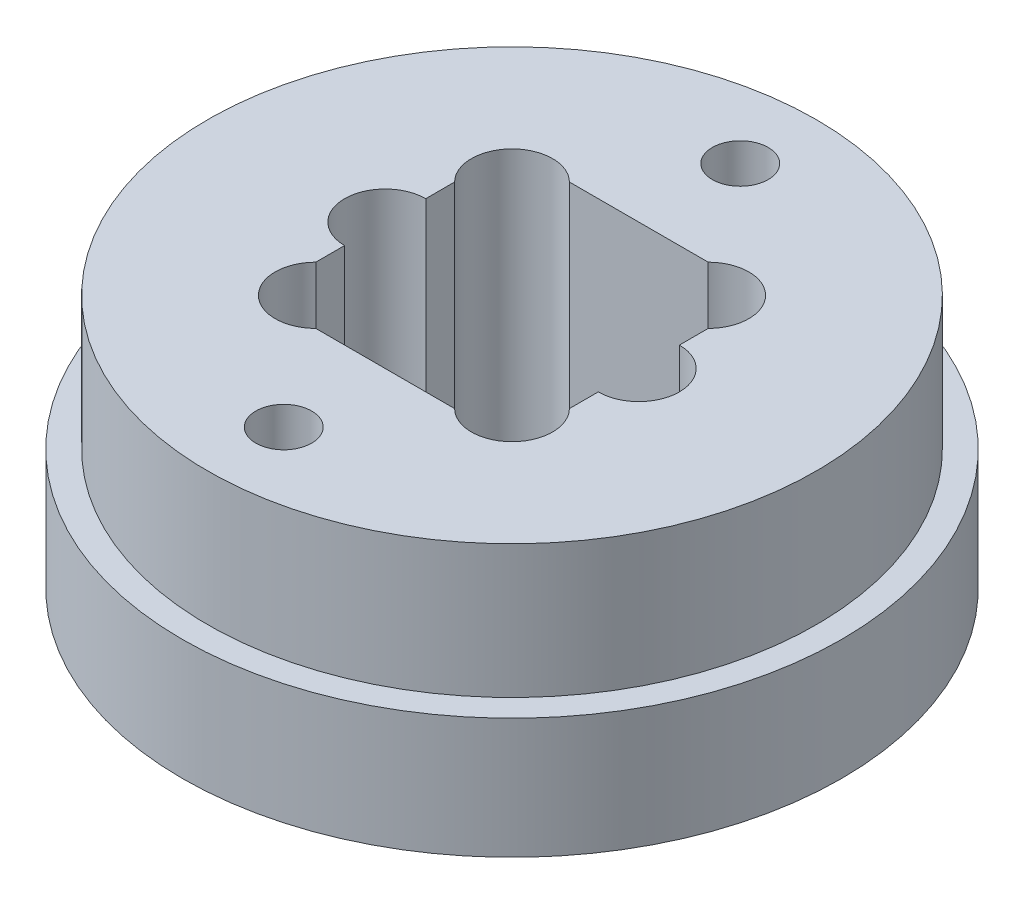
from build123d import *

# Parameters (mm, degrees)
ESQUISSE1_R             = 13
BOSS_EXTRU_1_DEPTH      = 4.75
ESQUISSE2_R             = 12
BOSS_EXTRU_2_DEPTH      = 5.25
ENL_V_START             = -10
ESQUISSE3_R             = 1.1
ENL_V_MAT_EXTRU_1_DEPTH = 10
ESQUISSE4_R             = 1.6
ENL_V_MAT_EXTRU_2_DEPTH = 10


with BuildPart() as part:
    # Esquisse1 → Boss.-Extru.1 (new body)
    with BuildSketch(Plane(origin=(0, 0, 0), x_dir=(1, 0, 0), z_dir=(0, 1, 0))):
        with Locations(Location((0, 0, 0), (0, 0, 270))):
            Circle(ESQUISSE1_R)
    extrude(amount=BOSS_EXTRU_1_DEPTH)

    # Esquisse2 → Boss.-Extru.2 (add)
    with BuildSketch(Plane(origin=(0, 4.75, 0), x_dir=(1, 0, 0), z_dir=(0, 1, 0))):
        with Locations(Location((0, 0, 0), (0, 0, 90))):
            Circle(ESQUISSE2_R)
    extrude(amount=BOSS_EXTRU_2_DEPTH)

    # Esquisse3 → Enl_v. mat.-Extru.1 (cut)
    with BuildSketch(Plane(origin=(0, 10, 0), x_dir=(1, 0, 0), z_dir=(0, 1, 0)).offset(ENL_V_START)):
        with Locations(Location((0, -9, 0), (0, 0, 270))):
            Circle(ESQUISSE3_R)
        with Locations(Location((0, 9, 0), (0, 0, 90))):
            Circle(ESQUISSE3_R)
        with BuildLine():
            Line((-2.7372583, 5), (2.7372583, 5))
            ThreePointArc((2.7372583, 5), (5, 5), (5, 2.7372583))
            Line((5, 2.7372583), (5, -2.7372583))
            ThreePointArc((5, -2.7372583), (5, -5), (2.7372583, -5))
            Line((2.7372583, -5), (-2.7372583, -5))
            ThreePointArc((-2.7372583, -5), (-5, -5), (-5, -2.7372583))
            Line((-5, -2.7372583), (-5, 2.7372583))
            ThreePointArc((-5, 2.7372583), (-5, 5), (-2.7372583, 5))
        make_face()
    extrude(amount=ENL_V_MAT_EXTRU_1_DEPTH, mode=Mode.SUBTRACT)

    # Esquisse4 → Enl_v. mat.-Extru.2 (cut)
    with BuildSketch(Plane(origin=(0, 0, 0), x_dir=(-1, 0, 0), z_dir=(0, -1, 0))):
        with Locations((5, 0)):
            Circle(ESQUISSE4_R)
        with Locations((-5, 0)):
            Circle(ESQUISSE4_R)
    extrude(amount=-ENL_V_MAT_EXTRU_2_DEPTH, mode=Mode.SUBTRACT)


solid = part.part
